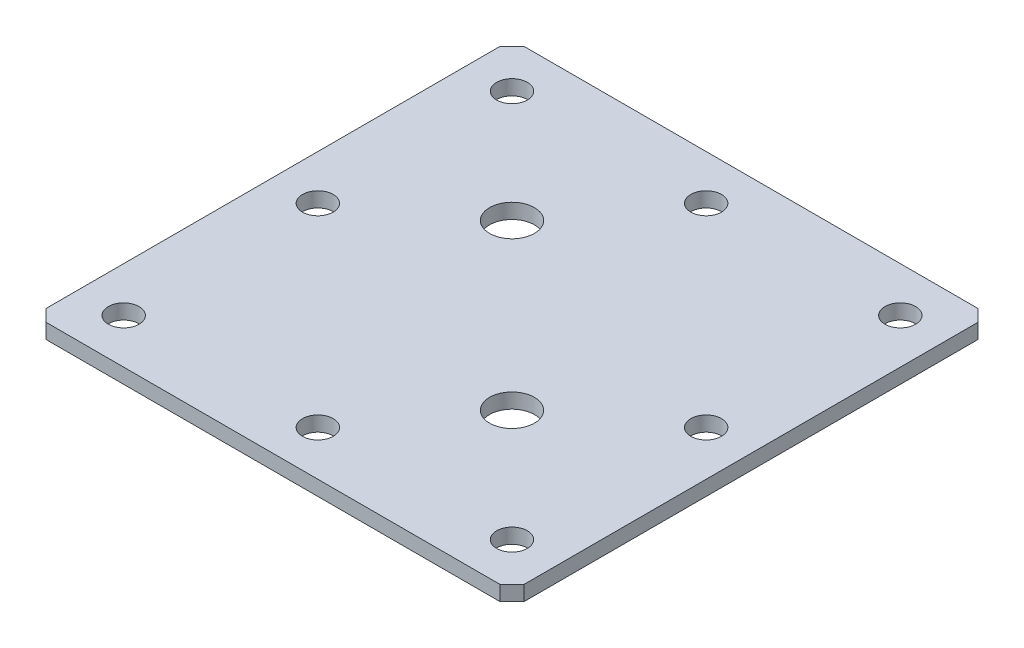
ISO-10303-21;
HEADER;
FILE_DESCRIPTION(('STEP AP214'),'2;1');
FILE_NAME('part.step','',(''),(''),'','','');
FILE_SCHEMA(('AUTOMOTIVE_DESIGN { 1 0 10303 214 1 1 1 1 }'));
ENDSEC;
DATA;
#1=APPLICATION_CONTEXT('core data for automotive mechanical design processes');
#2=APPLICATION_PROTOCOL_DEFINITION('international standard','automotive_design',2000,#1);
#3=PRODUCT_CONTEXT('',#1,'mechanical');
#4=PRODUCT('Part','Part','',(#3));
#5=PRODUCT_RELATED_PRODUCT_CATEGORY('part','',(#4));
#6=PRODUCT_DEFINITION_FORMATION('','',#4);
#7=PRODUCT_DEFINITION_CONTEXT('part definition',#1,'design');
#8=PRODUCT_DEFINITION('design','',#6,#7);
#9=PRODUCT_DEFINITION_SHAPE('','',#8);
#10=(LENGTH_UNIT() NAMED_UNIT(*) SI_UNIT(.MILLI.,.METRE.));
#11=(NAMED_UNIT(*) PLANE_ANGLE_UNIT() SI_UNIT($,.RADIAN.));
#12=(NAMED_UNIT(*) SI_UNIT($,.STERADIAN.) SOLID_ANGLE_UNIT());
#13=UNCERTAINTY_MEASURE_WITH_UNIT(LENGTH_MEASURE(1.E-05),#10,'distance_accuracy_value','');
#14=(GEOMETRIC_REPRESENTATION_CONTEXT(3) GLOBAL_UNCERTAINTY_ASSIGNED_CONTEXT((#13)) GLOBAL_UNIT_ASSIGNED_CONTEXT((#10,
#11,#12)) REPRESENTATION_CONTEXT('',''));
#15=CARTESIAN_POINT('',(0.,0.,0.));
#16=DIRECTION('',(0.,0.,1.));
#17=DIRECTION('',(1.,0.,0.));
#18=AXIS2_PLACEMENT_3D('',#15,#16,#17);
#19=CARTESIAN_POINT('',(-57.4104718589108,3.175,0.));
#20=DIRECTION('',(-1.,0.,0.));
#21=DIRECTION('',(0.,0.,1.));
#22=AXIS2_PLACEMENT_3D('',#19,#20,#21);
#23=PLANE('',#22);
#24=DIRECTION('',(0.,0.,-1.));
#25=VECTOR('',#24,1.);
#26=CARTESIAN_POINT('',(-57.4104718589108,0.,0.));
#27=LINE('',#26,#25);
#28=CARTESIAN_POINT('',(-57.4104718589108,0.,74.5771615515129));
#29=VERTEX_POINT('',#28);
#30=CARTESIAN_POINT('',(-57.4104718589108,0.,-21.9428384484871));
#31=VERTEX_POINT('',#30);
#32=EDGE_CURVE('E164',#29,#31,#27,.T.);
#33=ORIENTED_EDGE('',*,*,#32,.F.);
#34=DIRECTION('',(0.,-1.,0.));
#35=VECTOR('',#34,1.);
#36=CARTESIAN_POINT('',(-57.4104718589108,3.175,74.5771615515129));
#37=LINE('',#36,#35);
#38=CARTESIAN_POINT('',(-57.4104718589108,3.175,74.5771615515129));
#39=VERTEX_POINT('',#38);
#40=EDGE_CURVE('E11',#39,#29,#37,.T.);
#41=ORIENTED_EDGE('',*,*,#40,.F.);
#42=DIRECTION('',(0.,0.,-1.));
#43=VECTOR('',#42,1.);
#44=CARTESIAN_POINT('',(-57.4104718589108,3.175,0.));
#45=LINE('',#44,#43);
#46=CARTESIAN_POINT('',(-57.4104718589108,3.175,-21.9428384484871));
#47=VERTEX_POINT('',#46);
#48=EDGE_CURVE('E474',#39,#47,#45,.T.);
#49=ORIENTED_EDGE('',*,*,#48,.T.);
#50=DIRECTION('',(0.,-1.,0.));
#51=VECTOR('',#50,1.);
#52=CARTESIAN_POINT('',(-57.4104718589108,3.175,-21.9428384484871));
#53=LINE('',#52,#51);
#54=EDGE_CURVE('E56',#47,#31,#53,.T.);
#55=ORIENTED_EDGE('',*,*,#54,.T.);
#56=EDGE_LOOP('',(#33,#41,#49,#55));
#57=FACE_BOUND('',#56,.T.);
#58=ADVANCED_FACE('F39',(#57),#23,.T.);
#59=CARTESIAN_POINT('',(-65.9938167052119,3.175,65.9938167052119));
#60=DIRECTION('',(0.707106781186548,0.,-0.707106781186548));
#61=DIRECTION('',(-0.707106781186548,0.,-0.707106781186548));
#62=AXIS2_PLACEMENT_3D('',#59,#60,#61);
#63=PLANE('',#62);
#64=DIRECTION('',(0.707106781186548,0.,0.707106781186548));
#65=VECTOR('',#64,1.);
#66=CARTESIAN_POINT('',(-65.9938167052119,0.,65.9938167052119));
#67=LINE('',#66,#65);
#68=CARTESIAN_POINT('',(-54.8704718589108,0.,77.1171615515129));
#69=VERTEX_POINT('',#68);
#70=EDGE_CURVE('E166',#29,#69,#67,.T.);
#71=ORIENTED_EDGE('',*,*,#70,.T.);
#72=DIRECTION('',(0.,-1.,0.));
#73=VECTOR('',#72,1.);
#74=CARTESIAN_POINT('',(-54.8704718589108,3.175,77.1171615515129));
#75=LINE('',#74,#73);
#76=CARTESIAN_POINT('',(-54.8704718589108,3.175,77.1171615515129));
#77=VERTEX_POINT('',#76);
#78=EDGE_CURVE('E48',#77,#69,#75,.T.);
#79=ORIENTED_EDGE('',*,*,#78,.F.);
#80=DIRECTION('',(0.707106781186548,0.,0.707106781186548));
#81=VECTOR('',#80,1.);
#82=CARTESIAN_POINT('',(-65.9938167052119,3.175,65.9938167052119));
#83=LINE('',#82,#81);
#84=EDGE_CURVE('E470',#39,#77,#83,.T.);
#85=ORIENTED_EDGE('',*,*,#84,.F.);
#86=ORIENTED_EDGE('',*,*,#40,.T.);
#87=EDGE_LOOP('',(#71,#79,#85,#86));
#88=FACE_BOUND('',#87,.T.);
#89=ADVANCED_FACE('F209',(#88),#63,.F.);
#90=CARTESIAN_POINT('',(0.,3.175,77.1171615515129));
#91=DIRECTION('',(0.,0.,-1.));
#92=DIRECTION('',(-1.,0.,0.));
#93=AXIS2_PLACEMENT_3D('',#90,#91,#92);
#94=PLANE('',#93);
#95=DIRECTION('',(1.,0.,0.));
#96=VECTOR('',#95,1.);
#97=CARTESIAN_POINT('',(0.,0.,77.1171615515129));
#98=LINE('',#97,#96);
#99=CARTESIAN_POINT('',(41.6495281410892,0.,77.1171615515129));
#100=VERTEX_POINT('',#99);
#101=EDGE_CURVE('E169',#69,#100,#98,.T.);
#102=ORIENTED_EDGE('',*,*,#101,.T.);
#103=DIRECTION('',(0.,-1.,0.));
#104=VECTOR('',#103,1.);
#105=CARTESIAN_POINT('',(41.6495281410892,3.175,77.1171615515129));
#106=LINE('',#105,#104);
#107=CARTESIAN_POINT('',(41.6495281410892,3.175,77.1171615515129));
#108=VERTEX_POINT('',#107);
#109=EDGE_CURVE('E197',#108,#100,#106,.T.);
#110=ORIENTED_EDGE('',*,*,#109,.F.);
#111=DIRECTION('',(1.,0.,0.));
#112=VECTOR('',#111,1.);
#113=CARTESIAN_POINT('',(0.,3.175,77.1171615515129));
#114=LINE('',#113,#112);
#115=EDGE_CURVE('E205',#77,#108,#114,.T.);
#116=ORIENTED_EDGE('',*,*,#115,.F.);
#117=ORIENTED_EDGE('',*,*,#78,.T.);
#118=EDGE_LOOP('',(#102,#110,#116,#117));
#119=FACE_BOUND('',#118,.T.);
#120=ADVANCED_FACE('F202',(#119),#94,.F.);
#121=CARTESIAN_POINT('',(59.383344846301,3.175,59.383344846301));
#122=DIRECTION('',(-0.707106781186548,0.,-0.707106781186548));
#123=DIRECTION('',(-0.707106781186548,0.,0.707106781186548));
#124=AXIS2_PLACEMENT_3D('',#121,#122,#123);
#125=PLANE('',#124);
#126=DIRECTION('',(0.707106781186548,0.,-0.707106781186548));
#127=VECTOR('',#126,1.);
#128=CARTESIAN_POINT('',(59.383344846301,0.,59.383344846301));
#129=LINE('',#128,#127);
#130=CARTESIAN_POINT('',(44.1895281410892,0.,74.5771615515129));
#131=VERTEX_POINT('',#130);
#132=EDGE_CURVE('E172',#100,#131,#129,.T.);
#133=ORIENTED_EDGE('',*,*,#132,.T.);
#134=DIRECTION('',(0.,-1.,0.));
#135=VECTOR('',#134,1.);
#136=CARTESIAN_POINT('',(44.1895281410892,3.175,74.5771615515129));
#137=LINE('',#136,#135);
#138=CARTESIAN_POINT('',(44.1895281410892,3.175,74.5771615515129));
#139=VERTEX_POINT('',#138);
#140=EDGE_CURVE('E194',#139,#131,#137,.T.);
#141=ORIENTED_EDGE('',*,*,#140,.F.);
#142=DIRECTION('',(0.707106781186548,0.,-0.707106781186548));
#143=VECTOR('',#142,1.);
#144=CARTESIAN_POINT('',(59.383344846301,3.175,59.383344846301));
#145=LINE('',#144,#143);
#146=EDGE_CURVE('E468',#108,#139,#145,.T.);
#147=ORIENTED_EDGE('',*,*,#146,.F.);
#148=ORIENTED_EDGE('',*,*,#109,.T.);
#149=EDGE_LOOP('',(#133,#141,#147,#148));
#150=FACE_BOUND('',#149,.T.);
#151=ADVANCED_FACE('F302',(#150),#125,.F.);
#152=CARTESIAN_POINT('',(44.1895281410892,3.175,0.));
#153=DIRECTION('',(-1.,0.,0.));
#154=DIRECTION('',(0.,0.,1.));
#155=AXIS2_PLACEMENT_3D('',#152,#153,#154);
#156=PLANE('',#155);
#157=DIRECTION('',(0.,0.,-1.));
#158=VECTOR('',#157,1.);
#159=CARTESIAN_POINT('',(44.1895281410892,0.,0.));
#160=LINE('',#159,#158);
#161=CARTESIAN_POINT('',(44.1895281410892,0.,-21.9428384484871));
#162=VERTEX_POINT('',#161);
#163=EDGE_CURVE('E175',#131,#162,#160,.T.);
#164=ORIENTED_EDGE('',*,*,#163,.T.);
#165=DIRECTION('',(0.,-1.,0.));
#166=VECTOR('',#165,1.);
#167=CARTESIAN_POINT('',(44.1895281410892,3.175,-21.9428384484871));
#168=LINE('',#167,#166);
#169=CARTESIAN_POINT('',(44.1895281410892,3.175,-21.9428384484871));
#170=VERTEX_POINT('',#169);
#171=EDGE_CURVE('E115',#170,#162,#168,.T.);
#172=ORIENTED_EDGE('',*,*,#171,.F.);
#173=DIRECTION('',(0.,0.,-1.));
#174=VECTOR('',#173,1.);
#175=CARTESIAN_POINT('',(44.1895281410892,3.175,0.));
#176=LINE('',#175,#174);
#177=EDGE_CURVE('E125',#139,#170,#176,.T.);
#178=ORIENTED_EDGE('',*,*,#177,.F.);
#179=ORIENTED_EDGE('',*,*,#140,.T.);
#180=EDGE_LOOP('',(#164,#172,#178,#179));
#181=FACE_BOUND('',#180,.T.);
#182=ADVANCED_FACE('F299',(#181),#156,.F.);
#183=CARTESIAN_POINT('',(33.0661832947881,3.175,-33.0661832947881));
#184=DIRECTION('',(0.707106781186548,0.,-0.707106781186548));
#185=DIRECTION('',(-0.707106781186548,0.,-0.707106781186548));
#186=AXIS2_PLACEMENT_3D('',#183,#184,#185);
#187=PLANE('',#186);
#188=DIRECTION('',(0.707106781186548,0.,0.707106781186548));
#189=VECTOR('',#188,1.);
#190=CARTESIAN_POINT('',(33.0661832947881,0.,-33.0661832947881));
#191=LINE('',#190,#189);
#192=CARTESIAN_POINT('',(41.6495281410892,0.,-24.4828384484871));
#193=VERTEX_POINT('',#192);
#194=EDGE_CURVE('E111',#193,#162,#191,.T.);
#195=ORIENTED_EDGE('',*,*,#194,.F.);
#196=DIRECTION('',(0.,-1.,0.));
#197=VECTOR('',#196,1.);
#198=CARTESIAN_POINT('',(41.6495281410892,3.175,-24.4828384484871));
#199=LINE('',#198,#197);
#200=CARTESIAN_POINT('',(41.6495281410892,3.175,-24.4828384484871));
#201=VERTEX_POINT('',#200);
#202=EDGE_CURVE('E106',#201,#193,#199,.T.);
#203=ORIENTED_EDGE('',*,*,#202,.F.);
#204=DIRECTION('',(0.707106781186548,0.,0.707106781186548));
#205=VECTOR('',#204,1.);
#206=CARTESIAN_POINT('',(33.0661832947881,3.175,-33.0661832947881));
#207=LINE('',#206,#205);
#208=EDGE_CURVE('E109',#201,#170,#207,.T.);
#209=ORIENTED_EDGE('',*,*,#208,.T.);
#210=ORIENTED_EDGE('',*,*,#171,.T.);
#211=EDGE_LOOP('',(#195,#203,#209,#210));
#212=FACE_BOUND('',#211,.T.);
#213=ADVANCED_FACE('F108',(#212),#187,.T.);
#214=CARTESIAN_POINT('',(0.,3.175,-24.4828384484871));
#215=DIRECTION('',(0.,0.,-1.));
#216=DIRECTION('',(-1.,0.,0.));
#217=AXIS2_PLACEMENT_3D('',#214,#215,#216);
#218=PLANE('',#217);
#219=DIRECTION('',(1.,0.,0.));
#220=VECTOR('',#219,1.);
#221=CARTESIAN_POINT('',(0.,0.,-24.4828384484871));
#222=LINE('',#221,#220);
#223=CARTESIAN_POINT('',(-54.8704718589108,0.,-24.4828384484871));
#224=VERTEX_POINT('',#223);
#225=EDGE_CURVE('E179',#224,#193,#222,.T.);
#226=ORIENTED_EDGE('',*,*,#225,.F.);
#227=DIRECTION('',(0.,-1.,0.));
#228=VECTOR('',#227,1.);
#229=CARTESIAN_POINT('',(-54.8704718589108,3.175,-24.4828384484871));
#230=LINE('',#229,#228);
#231=CARTESIAN_POINT('',(-54.8704718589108,3.175,-24.4828384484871));
#232=VERTEX_POINT('',#231);
#233=EDGE_CURVE('E81',#232,#224,#230,.T.);
#234=ORIENTED_EDGE('',*,*,#233,.F.);
#235=DIRECTION('',(1.,0.,0.));
#236=VECTOR('',#235,1.);
#237=CARTESIAN_POINT('',(0.,3.175,-24.4828384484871));
#238=LINE('',#237,#236);
#239=EDGE_CURVE('E123',#232,#201,#238,.T.);
#240=ORIENTED_EDGE('',*,*,#239,.T.);
#241=ORIENTED_EDGE('',*,*,#202,.T.);
#242=EDGE_LOOP('',(#226,#234,#240,#241));
#243=FACE_BOUND('',#242,.T.);
#244=ADVANCED_FACE('F128',(#243),#218,.T.);
#245=CARTESIAN_POINT('',(10.8520281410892,3.175,43.7796615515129));
#246=DIRECTION('',(0.,-1.,0.));
#247=DIRECTION('',(0.,0.,-1.));
#248=AXIS2_PLACEMENT_3D('',#245,#246,#247);
#249=CYLINDRICAL_SURFACE('',#248,4.7625);
#250=CARTESIAN_POINT('',(10.8520281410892,3.175,43.7796615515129));
#251=DIRECTION('',(0.,1.,0.));
#252=DIRECTION('',(0.,0.,1.));
#253=AXIS2_PLACEMENT_3D('',#250,#251,#252);
#254=CIRCLE('',#253,4.7625);
#255=CARTESIAN_POINT('',(10.8520281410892,3.175,48.5421615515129));
#256=VERTEX_POINT('',#255);
#257=EDGE_CURVE('E131',#256,#256,#254,.T.);
#258=ORIENTED_EDGE('',*,*,#257,.T.);
#259=EDGE_LOOP('',(#258));
#260=FACE_BOUND('',#259,.T.);
#261=CARTESIAN_POINT('',(10.8520281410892,0.,43.7796615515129));
#262=DIRECTION('',(0.,1.,0.));
#263=DIRECTION('',(0.,0.,1.));
#264=AXIS2_PLACEMENT_3D('',#261,#262,#263);
#265=CIRCLE('',#264,4.7625);
#266=CARTESIAN_POINT('',(10.8520281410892,0.,48.5421615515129));
#267=VERTEX_POINT('',#266);
#268=EDGE_CURVE('E184',#267,#267,#265,.T.);
#269=ORIENTED_EDGE('',*,*,#268,.F.);
#270=EDGE_LOOP('',(#269));
#271=FACE_BOUND('',#270,.T.);
#272=ADVANCED_FACE('F289',(#260,#271),#249,.F.);
#273=CARTESIAN_POINT('',(-39.676655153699,3.175,-39.676655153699));
#274=DIRECTION('',(-0.707106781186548,0.,-0.707106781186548));
#275=DIRECTION('',(-0.707106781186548,0.,0.707106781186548));
#276=AXIS2_PLACEMENT_3D('',#273,#274,#275);
#277=PLANE('',#276);
#278=DIRECTION('',(0.707106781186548,0.,-0.707106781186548));
#279=VECTOR('',#278,1.);
#280=CARTESIAN_POINT('',(-39.676655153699,0.,-39.676655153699));
#281=LINE('',#280,#279);
#282=EDGE_CURVE('E181',#31,#224,#281,.T.);
#283=ORIENTED_EDGE('',*,*,#282,.F.);
#284=ORIENTED_EDGE('',*,*,#54,.F.);
#285=DIRECTION('',(0.707106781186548,0.,-0.707106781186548));
#286=VECTOR('',#285,1.);
#287=CARTESIAN_POINT('',(-39.676655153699,3.175,-39.676655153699));
#288=LINE('',#287,#286);
#289=EDGE_CURVE('E129',#47,#232,#288,.T.);
#290=ORIENTED_EDGE('',*,*,#289,.T.);
#291=ORIENTED_EDGE('',*,*,#233,.T.);
#292=EDGE_LOOP('',(#283,#284,#290,#291));
#293=FACE_BOUND('',#292,.T.);
#294=ADVANCED_FACE('F225',(#293),#277,.T.);
#295=CARTESIAN_POINT('',(-47.8854718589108,3.175,-14.9578384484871));
#296=DIRECTION('',(0.,-1.,0.));
#297=DIRECTION('',(0.,0.,-1.));
#298=AXIS2_PLACEMENT_3D('',#295,#296,#297);
#299=CYLINDRICAL_SURFACE('',#298,3.2639);
#300=CARTESIAN_POINT('',(-47.8854718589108,3.175,-14.9578384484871));
#301=DIRECTION('',(0.,1.,0.));
#302=DIRECTION('',(0.,0.,1.));
#303=AXIS2_PLACEMENT_3D('',#300,#301,#302);
#304=CIRCLE('',#303,3.2639);
#305=CARTESIAN_POINT('',(-47.8854718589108,3.175,-11.6939384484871));
#306=VERTEX_POINT('',#305);
#307=EDGE_CURVE('E476',#306,#306,#304,.T.);
#308=ORIENTED_EDGE('',*,*,#307,.T.);
#309=EDGE_LOOP('',(#308));
#310=FACE_BOUND('',#309,.T.);
#311=CARTESIAN_POINT('',(-47.8854718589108,0.,-14.9578384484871));
#312=DIRECTION('',(0.,1.,0.));
#313=DIRECTION('',(0.,0.,1.));
#314=AXIS2_PLACEMENT_3D('',#311,#312,#313);
#315=CIRCLE('',#314,3.2639);
#316=CARTESIAN_POINT('',(-47.8854718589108,0.,-11.6939384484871));
#317=VERTEX_POINT('',#316);
#318=EDGE_CURVE('E161',#317,#317,#315,.T.);
#319=ORIENTED_EDGE('',*,*,#318,.F.);
#320=EDGE_LOOP('',(#319));
#321=FACE_BOUND('',#320,.T.);
#322=ADVANCED_FACE('F221',(#310,#321),#299,.F.);
#323=CARTESIAN_POINT('',(34.6645281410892,3.175,-14.9578384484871));
#324=DIRECTION('',(0.,-1.,0.));
#325=DIRECTION('',(0.,0.,-1.));
#326=AXIS2_PLACEMENT_3D('',#323,#324,#325);
#327=CYLINDRICAL_SURFACE('',#326,3.2639);
#328=CARTESIAN_POINT('',(34.6645281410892,3.175,-14.9578384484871));
#329=DIRECTION('',(0.,1.,0.));
#330=DIRECTION('',(0.,0.,1.));
#331=AXIS2_PLACEMENT_3D('',#328,#329,#330);
#332=CIRCLE('',#331,3.2639);
#333=CARTESIAN_POINT('',(34.6645281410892,3.175,-11.6939384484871));
#334=VERTEX_POINT('',#333);
#335=EDGE_CURVE('E479',#334,#334,#332,.T.);
#336=ORIENTED_EDGE('',*,*,#335,.T.);
#337=EDGE_LOOP('',(#336));
#338=FACE_BOUND('',#337,.T.);
#339=CARTESIAN_POINT('',(34.6645281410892,0.,-14.9578384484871));
#340=DIRECTION('',(0.,1.,0.));
#341=DIRECTION('',(0.,0.,1.));
#342=AXIS2_PLACEMENT_3D('',#339,#340,#341);
#343=CIRCLE('',#342,3.2639);
#344=CARTESIAN_POINT('',(34.6645281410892,0.,-11.6939384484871));
#345=VERTEX_POINT('',#344);
#346=EDGE_CURVE('E158',#345,#345,#343,.T.);
#347=ORIENTED_EDGE('',*,*,#346,.F.);
#348=EDGE_LOOP('',(#347));
#349=FACE_BOUND('',#348,.T.);
#350=ADVANCED_FACE('F224',(#338,#349),#327,.F.);
#351=CARTESIAN_POINT('',(34.6645281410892,3.175,26.3171615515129));
#352=DIRECTION('',(0.,-1.,0.));
#353=DIRECTION('',(0.,0.,-1.));
#354=AXIS2_PLACEMENT_3D('',#351,#352,#353);
#355=CYLINDRICAL_SURFACE('',#354,3.2639);
#356=CARTESIAN_POINT('',(34.6645281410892,3.175,26.3171615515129));
#357=DIRECTION('',(0.,1.,0.));
#358=DIRECTION('',(0.,0.,1.));
#359=AXIS2_PLACEMENT_3D('',#356,#357,#358);
#360=CIRCLE('',#359,3.2639);
#361=CARTESIAN_POINT('',(34.6645281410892,3.175,29.5810615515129));
#362=VERTEX_POINT('',#361);
#363=EDGE_CURVE('E482',#362,#362,#360,.T.);
#364=ORIENTED_EDGE('',*,*,#363,.T.);
#365=EDGE_LOOP('',(#364));
#366=FACE_BOUND('',#365,.T.);
#367=CARTESIAN_POINT('',(34.6645281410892,0.,26.3171615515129));
#368=DIRECTION('',(0.,1.,0.));
#369=DIRECTION('',(0.,0.,1.));
#370=AXIS2_PLACEMENT_3D('',#367,#368,#369);
#371=CIRCLE('',#370,3.2639);
#372=CARTESIAN_POINT('',(34.6645281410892,0.,29.5810615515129));
#373=VERTEX_POINT('',#372);
#374=EDGE_CURVE('E155',#373,#373,#371,.T.);
#375=ORIENTED_EDGE('',*,*,#374,.F.);
#376=EDGE_LOOP('',(#375));
#377=FACE_BOUND('',#376,.T.);
#378=ADVANCED_FACE('F229',(#366,#377),#355,.F.);
#379=CARTESIAN_POINT('',(34.6645281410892,3.175,67.5921615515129));
#380=DIRECTION('',(0.,-1.,0.));
#381=DIRECTION('',(0.,0.,-1.));
#382=AXIS2_PLACEMENT_3D('',#379,#380,#381);
#383=CYLINDRICAL_SURFACE('',#382,3.2639);
#384=CARTESIAN_POINT('',(34.6645281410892,3.175,67.5921615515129));
#385=DIRECTION('',(0.,1.,0.));
#386=DIRECTION('',(0.,0.,1.));
#387=AXIS2_PLACEMENT_3D('',#384,#385,#386);
#388=CIRCLE('',#387,3.2639);
#389=CARTESIAN_POINT('',(34.6645281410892,3.175,70.8560615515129));
#390=VERTEX_POINT('',#389);
#391=EDGE_CURVE('E485',#390,#390,#388,.T.);
#392=ORIENTED_EDGE('',*,*,#391,.T.);
#393=EDGE_LOOP('',(#392));
#394=FACE_BOUND('',#393,.T.);
#395=CARTESIAN_POINT('',(34.6645281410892,0.,67.5921615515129));
#396=DIRECTION('',(0.,1.,0.));
#397=DIRECTION('',(0.,0.,1.));
#398=AXIS2_PLACEMENT_3D('',#395,#396,#397);
#399=CIRCLE('',#398,3.2639);
#400=CARTESIAN_POINT('',(34.6645281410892,0.,70.8560615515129));
#401=VERTEX_POINT('',#400);
#402=EDGE_CURVE('E152',#401,#401,#399,.T.);
#403=ORIENTED_EDGE('',*,*,#402,.F.);
#404=EDGE_LOOP('',(#403));
#405=FACE_BOUND('',#404,.T.);
#406=ADVANCED_FACE('F233',(#394,#405),#383,.F.);
#407=CARTESIAN_POINT('',(-47.8854718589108,3.175,67.5921615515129));
#408=DIRECTION('',(0.,-1.,0.));
#409=DIRECTION('',(0.,0.,-1.));
#410=AXIS2_PLACEMENT_3D('',#407,#408,#409);
#411=CYLINDRICAL_SURFACE('',#410,3.2639);
#412=CARTESIAN_POINT('',(-47.8854718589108,3.175,67.5921615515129));
#413=DIRECTION('',(0.,1.,0.));
#414=DIRECTION('',(0.,0.,1.));
#415=AXIS2_PLACEMENT_3D('',#412,#413,#414);
#416=CIRCLE('',#415,3.2639);
#417=CARTESIAN_POINT('',(-47.8854718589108,3.175,70.8560615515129));
#418=VERTEX_POINT('',#417);
#419=EDGE_CURVE('E488',#418,#418,#416,.T.);
#420=ORIENTED_EDGE('',*,*,#419,.T.);
#421=EDGE_LOOP('',(#420));
#422=FACE_BOUND('',#421,.T.);
#423=CARTESIAN_POINT('',(-47.8854718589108,0.,67.5921615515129));
#424=DIRECTION('',(0.,1.,0.));
#425=DIRECTION('',(0.,0.,1.));
#426=AXIS2_PLACEMENT_3D('',#423,#424,#425);
#427=CIRCLE('',#426,3.2639);
#428=CARTESIAN_POINT('',(-47.8854718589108,0.,70.8560615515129));
#429=VERTEX_POINT('',#428);
#430=EDGE_CURVE('E149',#429,#429,#427,.T.);
#431=ORIENTED_EDGE('',*,*,#430,.F.);
#432=EDGE_LOOP('',(#431));
#433=FACE_BOUND('',#432,.T.);
#434=ADVANCED_FACE('F237',(#422,#433),#411,.F.);
#435=CARTESIAN_POINT('',(-47.8854718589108,3.175,26.3171615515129));
#436=DIRECTION('',(0.,-1.,0.));
#437=DIRECTION('',(0.,0.,-1.));
#438=AXIS2_PLACEMENT_3D('',#435,#436,#437);
#439=CYLINDRICAL_SURFACE('',#438,3.2639);
#440=CARTESIAN_POINT('',(-47.8854718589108,3.175,26.3171615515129));
#441=DIRECTION('',(0.,1.,0.));
#442=DIRECTION('',(0.,0.,1.));
#443=AXIS2_PLACEMENT_3D('',#440,#441,#442);
#444=CIRCLE('',#443,3.2639);
#445=CARTESIAN_POINT('',(-47.8854718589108,3.175,29.5810615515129));
#446=VERTEX_POINT('',#445);
#447=EDGE_CURVE('E491',#446,#446,#444,.T.);
#448=ORIENTED_EDGE('',*,*,#447,.T.);
#449=EDGE_LOOP('',(#448));
#450=FACE_BOUND('',#449,.T.);
#451=CARTESIAN_POINT('',(-47.8854718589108,0.,26.3171615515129));
#452=DIRECTION('',(0.,1.,0.));
#453=DIRECTION('',(0.,0.,1.));
#454=AXIS2_PLACEMENT_3D('',#451,#452,#453);
#455=CIRCLE('',#454,3.2639);
#456=CARTESIAN_POINT('',(-47.8854718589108,0.,29.5810615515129));
#457=VERTEX_POINT('',#456);
#458=EDGE_CURVE('E146',#457,#457,#455,.T.);
#459=ORIENTED_EDGE('',*,*,#458,.F.);
#460=EDGE_LOOP('',(#459));
#461=FACE_BOUND('',#460,.T.);
#462=ADVANCED_FACE('F241',(#450,#461),#439,.F.);
#463=CARTESIAN_POINT('',(-6.61047185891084,3.175,-14.9578384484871));
#464=DIRECTION('',(0.,-1.,0.));
#465=DIRECTION('',(0.,0.,-1.));
#466=AXIS2_PLACEMENT_3D('',#463,#464,#465);
#467=CYLINDRICAL_SURFACE('',#466,3.2639);
#468=CARTESIAN_POINT('',(-6.61047185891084,3.175,-14.9578384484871));
#469=DIRECTION('',(0.,1.,0.));
#470=DIRECTION('',(0.,0.,1.));
#471=AXIS2_PLACEMENT_3D('',#468,#469,#470);
#472=CIRCLE('',#471,3.2639);
#473=CARTESIAN_POINT('',(-6.61047185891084,3.175,-11.6939384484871));
#474=VERTEX_POINT('',#473);
#475=EDGE_CURVE('E256',#474,#474,#472,.T.);
#476=ORIENTED_EDGE('',*,*,#475,.T.);
#477=EDGE_LOOP('',(#476));
#478=FACE_BOUND('',#477,.T.);
#479=CARTESIAN_POINT('',(-6.61047185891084,0.,-14.9578384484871));
#480=DIRECTION('',(0.,1.,0.));
#481=DIRECTION('',(0.,0.,1.));
#482=AXIS2_PLACEMENT_3D('',#479,#480,#481);
#483=CIRCLE('',#482,3.2639);
#484=CARTESIAN_POINT('',(-6.61047185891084,0.,-11.6939384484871));
#485=VERTEX_POINT('',#484);
#486=EDGE_CURVE('E143',#485,#485,#483,.T.);
#487=ORIENTED_EDGE('',*,*,#486,.F.);
#488=EDGE_LOOP('',(#487));
#489=FACE_BOUND('',#488,.T.);
#490=ADVANCED_FACE('F244',(#478,#489),#467,.F.);
#491=CARTESIAN_POINT('',(-6.61047185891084,3.175,67.5921615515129));
#492=DIRECTION('',(0.,-1.,0.));
#493=DIRECTION('',(0.,0.,-1.));
#494=AXIS2_PLACEMENT_3D('',#491,#492,#493);
#495=CYLINDRICAL_SURFACE('',#494,3.2639);
#496=CARTESIAN_POINT('',(-6.61047185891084,3.175,67.5921615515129));
#497=DIRECTION('',(0.,1.,0.));
#498=DIRECTION('',(0.,0.,1.));
#499=AXIS2_PLACEMENT_3D('',#496,#497,#498);
#500=CIRCLE('',#499,3.2639);
#501=CARTESIAN_POINT('',(-6.61047185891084,3.175,70.8560615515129));
#502=VERTEX_POINT('',#501);
#503=EDGE_CURVE('E190',#502,#502,#500,.T.);
#504=ORIENTED_EDGE('',*,*,#503,.T.);
#505=EDGE_LOOP('',(#504));
#506=FACE_BOUND('',#505,.T.);
#507=CARTESIAN_POINT('',(-6.61047185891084,0.,67.5921615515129));
#508=DIRECTION('',(0.,1.,0.));
#509=DIRECTION('',(0.,0.,1.));
#510=AXIS2_PLACEMENT_3D('',#507,#508,#509);
#511=CIRCLE('',#510,3.2639);
#512=CARTESIAN_POINT('',(-6.61047185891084,0.,70.8560615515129));
#513=VERTEX_POINT('',#512);
#514=EDGE_CURVE('E140',#513,#513,#511,.T.);
#515=ORIENTED_EDGE('',*,*,#514,.F.);
#516=EDGE_LOOP('',(#515));
#517=FACE_BOUND('',#516,.T.);
#518=ADVANCED_FACE('F41',(#506,#517),#495,.F.);
#519=CARTESIAN_POINT('',(-24.0729718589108,3.175,8.85466155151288));
#520=DIRECTION('',(0.,-1.,0.));
#521=DIRECTION('',(0.,0.,-1.));
#522=AXIS2_PLACEMENT_3D('',#519,#520,#521);
#523=CYLINDRICAL_SURFACE('',#522,4.7625);
#524=CARTESIAN_POINT('',(-24.0729718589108,3.175,8.85466155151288));
#525=DIRECTION('',(0.,1.,0.));
#526=DIRECTION('',(0.,0.,1.));
#527=AXIS2_PLACEMENT_3D('',#524,#525,#526);
#528=CIRCLE('',#527,4.7625);
#529=CARTESIAN_POINT('',(-24.0729718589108,3.175,13.6171615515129));
#530=VERTEX_POINT('',#529);
#531=EDGE_CURVE('E137',#530,#530,#528,.T.);
#532=ORIENTED_EDGE('',*,*,#531,.T.);
#533=EDGE_LOOP('',(#532));
#534=FACE_BOUND('',#533,.T.);
#535=CARTESIAN_POINT('',(-24.0729718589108,0.,8.85466155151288));
#536=DIRECTION('',(0.,1.,0.));
#537=DIRECTION('',(0.,0.,1.));
#538=AXIS2_PLACEMENT_3D('',#535,#536,#537);
#539=CIRCLE('',#538,4.7625);
#540=CARTESIAN_POINT('',(-24.0729718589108,0.,13.6171615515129));
#541=VERTEX_POINT('',#540);
#542=EDGE_CURVE('E187',#541,#541,#539,.T.);
#543=ORIENTED_EDGE('',*,*,#542,.F.);
#544=EDGE_LOOP('',(#543));
#545=FACE_BOUND('',#544,.T.);
#546=ADVANCED_FACE('F251',(#534,#545),#523,.F.);
#547=CARTESIAN_POINT('',(0.,3.175,0.));
#548=DIRECTION('',(0.,1.,0.));
#549=DIRECTION('',(0.,0.,1.));
#550=AXIS2_PLACEMENT_3D('',#547,#548,#549);
#551=PLANE('',#550);
#552=ORIENTED_EDGE('',*,*,#503,.F.);
#553=EDGE_LOOP('',(#552));
#554=FACE_BOUND('',#553,.T.);
#555=ORIENTED_EDGE('',*,*,#475,.F.);
#556=EDGE_LOOP('',(#555));
#557=FACE_BOUND('',#556,.T.);
#558=ORIENTED_EDGE('',*,*,#447,.F.);
#559=EDGE_LOOP('',(#558));
#560=FACE_BOUND('',#559,.T.);
#561=ORIENTED_EDGE('',*,*,#419,.F.);
#562=EDGE_LOOP('',(#561));
#563=FACE_BOUND('',#562,.T.);
#564=ORIENTED_EDGE('',*,*,#391,.F.);
#565=EDGE_LOOP('',(#564));
#566=FACE_BOUND('',#565,.T.);
#567=ORIENTED_EDGE('',*,*,#363,.F.);
#568=EDGE_LOOP('',(#567));
#569=FACE_BOUND('',#568,.T.);
#570=ORIENTED_EDGE('',*,*,#335,.F.);
#571=EDGE_LOOP('',(#570));
#572=FACE_BOUND('',#571,.T.);
#573=ORIENTED_EDGE('',*,*,#307,.F.);
#574=EDGE_LOOP('',(#573));
#575=FACE_BOUND('',#574,.T.);
#576=ORIENTED_EDGE('',*,*,#48,.F.);
#577=ORIENTED_EDGE('',*,*,#84,.T.);
#578=ORIENTED_EDGE('',*,*,#115,.T.);
#579=ORIENTED_EDGE('',*,*,#146,.T.);
#580=ORIENTED_EDGE('',*,*,#177,.T.);
#581=ORIENTED_EDGE('',*,*,#208,.F.);
#582=ORIENTED_EDGE('',*,*,#239,.F.);
#583=ORIENTED_EDGE('',*,*,#289,.F.);
#584=EDGE_LOOP('',(#576,#577,#578,#579,#580,#581,#582,#583));
#585=FACE_BOUND('',#584,.T.);
#586=ORIENTED_EDGE('',*,*,#257,.F.);
#587=EDGE_LOOP('',(#586));
#588=FACE_BOUND('',#587,.T.);
#589=ORIENTED_EDGE('',*,*,#531,.F.);
#590=EDGE_LOOP('',(#589));
#591=FACE_BOUND('',#590,.T.);
#592=ADVANCED_FACE('F120',(#554,#557,#560,#563,#566,#569,#572,#575,#585,#588,#591),#551,.T.);
#593=CARTESIAN_POINT('',(0.,0.,0.));
#594=DIRECTION('',(0.,1.,0.));
#595=DIRECTION('',(0.,0.,1.));
#596=AXIS2_PLACEMENT_3D('',#593,#594,#595);
#597=PLANE('',#596);
#598=ORIENTED_EDGE('',*,*,#514,.T.);
#599=EDGE_LOOP('',(#598));
#600=FACE_BOUND('',#599,.T.);
#601=ORIENTED_EDGE('',*,*,#486,.T.);
#602=EDGE_LOOP('',(#601));
#603=FACE_BOUND('',#602,.T.);
#604=ORIENTED_EDGE('',*,*,#458,.T.);
#605=EDGE_LOOP('',(#604));
#606=FACE_BOUND('',#605,.T.);
#607=ORIENTED_EDGE('',*,*,#430,.T.);
#608=EDGE_LOOP('',(#607));
#609=FACE_BOUND('',#608,.T.);
#610=ORIENTED_EDGE('',*,*,#402,.T.);
#611=EDGE_LOOP('',(#610));
#612=FACE_BOUND('',#611,.T.);
#613=ORIENTED_EDGE('',*,*,#374,.T.);
#614=EDGE_LOOP('',(#613));
#615=FACE_BOUND('',#614,.T.);
#616=ORIENTED_EDGE('',*,*,#346,.T.);
#617=EDGE_LOOP('',(#616));
#618=FACE_BOUND('',#617,.T.);
#619=ORIENTED_EDGE('',*,*,#318,.T.);
#620=EDGE_LOOP('',(#619));
#621=FACE_BOUND('',#620,.T.);
#622=ORIENTED_EDGE('',*,*,#32,.T.);
#623=ORIENTED_EDGE('',*,*,#282,.T.);
#624=ORIENTED_EDGE('',*,*,#225,.T.);
#625=ORIENTED_EDGE('',*,*,#194,.T.);
#626=ORIENTED_EDGE('',*,*,#163,.F.);
#627=ORIENTED_EDGE('',*,*,#132,.F.);
#628=ORIENTED_EDGE('',*,*,#101,.F.);
#629=ORIENTED_EDGE('',*,*,#70,.F.);
#630=EDGE_LOOP('',(#622,#623,#624,#625,#626,#627,#628,#629));
#631=FACE_BOUND('',#630,.T.);
#632=ORIENTED_EDGE('',*,*,#268,.T.);
#633=EDGE_LOOP('',(#632));
#634=FACE_BOUND('',#633,.T.);
#635=ORIENTED_EDGE('',*,*,#542,.T.);
#636=EDGE_LOOP('',(#635));
#637=FACE_BOUND('',#636,.T.);
#638=ADVANCED_FACE('F211',(#600,#603,#606,#609,#612,#615,#618,#621,#631,#634,#637),#597,.F.);
#639=CLOSED_SHELL('',(#58,#89,#120,#151,#182,#213,#244,#272,#294,#322,#350,#378,#406,#434,#462,
#490,#518,#546,#592,#638));
#640=MANIFOLD_SOLID_BREP('B2',#639);
#641=ADVANCED_BREP_SHAPE_REPRESENTATION('',(#18,#640),#14);
#642=SHAPE_DEFINITION_REPRESENTATION(#9,#641);
ENDSEC;
END-ISO-10303-21;
